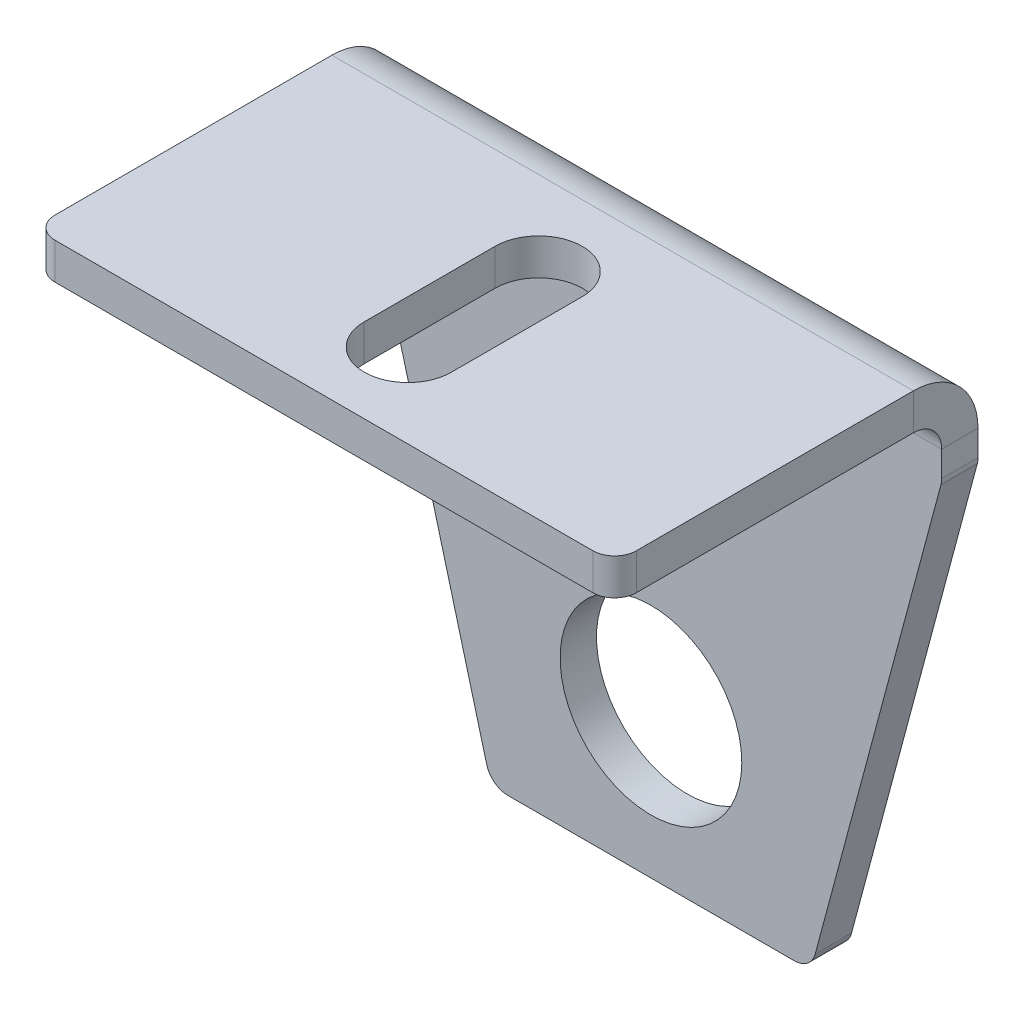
ISO-10303-21;
HEADER;
FILE_DESCRIPTION(('STEP AP214'),'2;1');
FILE_NAME('part.step','',(''),(''),'','','');
FILE_SCHEMA(('AUTOMOTIVE_DESIGN { 1 0 10303 214 1 1 1 1 }'));
ENDSEC;
DATA;
#1=APPLICATION_CONTEXT('core data for automotive mechanical design processes');
#2=APPLICATION_PROTOCOL_DEFINITION('international standard','automotive_design',2000,#1);
#3=PRODUCT_CONTEXT('',#1,'mechanical');
#4=PRODUCT('Part','Part','',(#3));
#5=PRODUCT_RELATED_PRODUCT_CATEGORY('part','',(#4));
#6=PRODUCT_DEFINITION_FORMATION('','',#4);
#7=PRODUCT_DEFINITION_CONTEXT('part definition',#1,'design');
#8=PRODUCT_DEFINITION('design','',#6,#7);
#9=PRODUCT_DEFINITION_SHAPE('','',#8);
#10=(LENGTH_UNIT() NAMED_UNIT(*) SI_UNIT(.MILLI.,.METRE.));
#11=(NAMED_UNIT(*) PLANE_ANGLE_UNIT() SI_UNIT($,.RADIAN.));
#12=(NAMED_UNIT(*) SI_UNIT($,.STERADIAN.) SOLID_ANGLE_UNIT());
#13=UNCERTAINTY_MEASURE_WITH_UNIT(LENGTH_MEASURE(1.E-05),#10,'distance_accuracy_value','');
#14=(GEOMETRIC_REPRESENTATION_CONTEXT(3) GLOBAL_UNCERTAINTY_ASSIGNED_CONTEXT((#13)) GLOBAL_UNIT_ASSIGNED_CONTEXT((#10,
#11,#12)) REPRESENTATION_CONTEXT('',''));
#15=CARTESIAN_POINT('',(0.,0.,0.));
#16=DIRECTION('',(0.,0.,1.));
#17=DIRECTION('',(1.,0.,0.));
#18=AXIS2_PLACEMENT_3D('',#15,#16,#17);
#19=CARTESIAN_POINT('',(-40.,-40.,-5.));
#20=DIRECTION('',(-1.,0.,0.));
#21=DIRECTION('',(0.,0.,1.));
#22=AXIS2_PLACEMENT_3D('',#19,#20,#21);
#23=PLANE('',#22);
#24=DIRECTION('',(0.,-1.,0.));
#25=VECTOR('',#24,1.);
#26=CARTESIAN_POINT('',(-40.,-40.,-5.));
#27=LINE('',#26,#25);
#28=CARTESIAN_POINT('',(-40.,31.1,-5.));
#29=VERTEX_POINT('',#28);
#30=CARTESIAN_POINT('',(-40.,27.5718720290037,-5.));
#31=VERTEX_POINT('',#30);
#32=EDGE_CURVE('E297',#29,#31,#27,.T.);
#33=ORIENTED_EDGE('',*,*,#32,.T.);
#34=DIRECTION('',(0.,0.,1.));
#35=VECTOR('',#34,1.);
#36=CARTESIAN_POINT('',(-40.,27.5718720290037,-5.));
#37=LINE('',#36,#35);
#38=CARTESIAN_POINT('',(-40.,27.5718720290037,0.));
#39=VERTEX_POINT('',#38);
#40=EDGE_CURVE('E345',#31,#39,#37,.T.);
#41=ORIENTED_EDGE('',*,*,#40,.T.);
#42=DIRECTION('',(0.,-1.,0.));
#43=VECTOR('',#42,1.);
#44=CARTESIAN_POINT('',(-40.,-40.,0.));
#45=LINE('',#44,#43);
#46=CARTESIAN_POINT('',(-40.,31.1,0.));
#47=VERTEX_POINT('',#46);
#48=EDGE_CURVE('E294',#47,#39,#45,.T.);
#49=ORIENTED_EDGE('',*,*,#48,.F.);
#50=DIRECTION('',(0.,0.,-1.));
#51=VECTOR('',#50,1.);
#52=CARTESIAN_POINT('',(-40.,31.1,0.));
#53=LINE('',#52,#51);
#54=EDGE_CURVE('E280',#47,#29,#53,.T.);
#55=ORIENTED_EDGE('',*,*,#54,.T.);
#56=EDGE_LOOP('',(#33,#41,#49,#55));
#57=FACE_BOUND('',#56,.T.);
#58=ADVANCED_FACE('F54',(#57),#23,.T.);
#59=CARTESIAN_POINT('',(0.,0.,-5.));
#60=DIRECTION('',(0.,0.,1.));
#61=DIRECTION('',(1.,0.,0.));
#62=AXIS2_PLACEMENT_3D('',#59,#60,#61);
#63=PLANE('',#62);
#64=CARTESIAN_POINT('',(0.,-19.9999999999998,-5.));
#65=DIRECTION('',(0.,0.,1.));
#66=DIRECTION('',(1.,0.,0.));
#67=AXIS2_PLACEMENT_3D('',#64,#65,#66);
#68=CIRCLE('',#67,12.5);
#69=CARTESIAN_POINT('',(12.5,-19.9999999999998,-5.));
#70=VERTEX_POINT('',#69);
#71=EDGE_CURVE('E242',#70,#70,#68,.F.);
#72=ORIENTED_EDGE('',*,*,#71,.F.);
#73=EDGE_LOOP('',(#72));
#74=FACE_BOUND('',#73,.T.);
#75=DIRECTION('',(1.,0.,0.));
#76=VECTOR('',#75,1.);
#77=CARTESIAN_POINT('',(40.,-40.,-5.));
#78=LINE('',#77,#76);
#79=CARTESIAN_POINT('',(-19.6980190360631,-40.,-5.));
#80=VERTEX_POINT('',#79);
#81=CARTESIAN_POINT('',(19.6980190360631,-40.,-5.));
#82=VERTEX_POINT('',#81);
#83=EDGE_CURVE('E300',#80,#82,#78,.T.);
#84=ORIENTED_EDGE('',*,*,#83,.F.);
#85=CARTESIAN_POINT('',(-19.6980190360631,-37.,-5.));
#86=DIRECTION('',(0.,0.,1.));
#87=DIRECTION('',(1.,0.,0.));
#88=AXIS2_PLACEMENT_3D('',#85,#86,#87);
#89=CIRCLE('',#88,3.);
#90=CARTESIAN_POINT('',(-22.5957965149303,-37.7764571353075,-5.));
#91=VERTEX_POINT('',#90);
#92=EDGE_CURVE('E336',#80,#91,#89,.F.);
#93=ORIENTED_EDGE('',*,*,#92,.T.);
#94=DIRECTION('',(0.258819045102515,-0.96592582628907,0.));
#95=VECTOR('',#94,1.);
#96=CARTESIAN_POINT('',(-40.,27.1769145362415,-5.));
#97=LINE('',#96,#95);
#98=CARTESIAN_POINT('',(-39.8977774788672,26.7954148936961,-5.));
#99=VERTEX_POINT('',#98);
#100=EDGE_CURVE('E232',#99,#91,#97,.T.);
#101=ORIENTED_EDGE('',*,*,#100,.F.);
#102=CARTESIAN_POINT('',(-37.,27.5718720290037,-5.));
#103=DIRECTION('',(0.,0.,1.));
#104=DIRECTION('',(1.,0.,0.));
#105=AXIS2_PLACEMENT_3D('',#102,#103,#104);
#106=CIRCLE('',#105,3.);
#107=EDGE_CURVE('E330',#99,#31,#106,.F.);
#108=ORIENTED_EDGE('',*,*,#107,.T.);
#109=ORIENTED_EDGE('',*,*,#32,.F.);
#110=DIRECTION('',(-1.,0.,0.));
#111=VECTOR('',#110,1.);
#112=CARTESIAN_POINT('',(-40.,31.1,-5.));
#113=LINE('',#112,#111);
#114=CARTESIAN_POINT('',(40.,31.1000000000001,-5.));
#115=VERTEX_POINT('',#114);
#116=EDGE_CURVE('E273',#29,#115,#113,.F.);
#117=ORIENTED_EDGE('',*,*,#116,.T.);
#118=DIRECTION('',(0.,1.,0.));
#119=VECTOR('',#118,1.);
#120=CARTESIAN_POINT('',(40.,-40.,-5.));
#121=LINE('',#120,#119);
#122=CARTESIAN_POINT('',(40.,27.5718720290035,-5.));
#123=VERTEX_POINT('',#122);
#124=EDGE_CURVE('E304',#123,#115,#121,.T.);
#125=ORIENTED_EDGE('',*,*,#124,.F.);
#126=CARTESIAN_POINT('',(37.,27.5718720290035,-5.));
#127=DIRECTION('',(0.,0.,1.));
#128=DIRECTION('',(1.,0.,0.));
#129=AXIS2_PLACEMENT_3D('',#126,#127,#128);
#130=CIRCLE('',#129,3.);
#131=CARTESIAN_POINT('',(39.8977774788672,26.7954148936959,-5.));
#132=VERTEX_POINT('',#131);
#133=EDGE_CURVE('E332',#123,#132,#130,.F.);
#134=ORIENTED_EDGE('',*,*,#133,.T.);
#135=DIRECTION('',(0.258819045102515,0.96592582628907,0.));
#136=VECTOR('',#135,1.);
#137=CARTESIAN_POINT('',(40.,27.1769145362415,-5.));
#138=LINE('',#137,#136);
#139=CARTESIAN_POINT('',(22.5957965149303,-37.7764571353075,-5.));
#140=VERTEX_POINT('',#139);
#141=EDGE_CURVE('E224',#140,#132,#138,.T.);
#142=ORIENTED_EDGE('',*,*,#141,.F.);
#143=CARTESIAN_POINT('',(19.6980190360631,-37.,-5.));
#144=DIRECTION('',(0.,0.,1.));
#145=DIRECTION('',(1.,0.,0.));
#146=AXIS2_PLACEMENT_3D('',#143,#144,#145);
#147=CIRCLE('',#146,3.);
#148=EDGE_CURVE('E334',#140,#82,#147,.F.);
#149=ORIENTED_EDGE('',*,*,#148,.T.);
#150=EDGE_LOOP('',(#84,#93,#101,#108,#109,#117,#125,#134,#142,#149));
#151=FACE_BOUND('',#150,.T.);
#152=ADVANCED_FACE('F441',(#74,#151),#63,.F.);
#153=CARTESIAN_POINT('',(0.,0.,0.));
#154=DIRECTION('',(0.,0.,1.));
#155=DIRECTION('',(1.,0.,0.));
#156=AXIS2_PLACEMENT_3D('',#153,#154,#155);
#157=PLANE('',#156);
#158=CARTESIAN_POINT('',(0.,-19.9999999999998,0.));
#159=DIRECTION('',(0.,0.,1.));
#160=DIRECTION('',(1.,0.,0.));
#161=AXIS2_PLACEMENT_3D('',#158,#159,#160);
#162=CIRCLE('',#161,12.5);
#163=CARTESIAN_POINT('',(12.5,-19.9999999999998,0.));
#164=VERTEX_POINT('',#163);
#165=EDGE_CURVE('E231',#164,#164,#162,.T.);
#166=ORIENTED_EDGE('',*,*,#165,.F.);
#167=EDGE_LOOP('',(#166));
#168=FACE_BOUND('',#167,.T.);
#169=DIRECTION('',(0.258819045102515,-0.96592582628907,0.));
#170=VECTOR('',#169,1.);
#171=CARTESIAN_POINT('',(-40.,27.1769145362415,0.));
#172=LINE('',#171,#170);
#173=CARTESIAN_POINT('',(-39.8977774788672,26.7954148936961,0.));
#174=VERTEX_POINT('',#173);
#175=CARTESIAN_POINT('',(-22.5957965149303,-37.7764571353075,0.));
#176=VERTEX_POINT('',#175);
#177=EDGE_CURVE('E228',#174,#176,#172,.T.);
#178=ORIENTED_EDGE('',*,*,#177,.T.);
#179=CARTESIAN_POINT('',(-19.6980190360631,-37.,0.));
#180=DIRECTION('',(0.,0.,1.));
#181=DIRECTION('',(1.,0.,0.));
#182=AXIS2_PLACEMENT_3D('',#179,#180,#181);
#183=CIRCLE('',#182,3.);
#184=CARTESIAN_POINT('',(-19.6980190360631,-40.,0.));
#185=VERTEX_POINT('',#184);
#186=EDGE_CURVE('E323',#176,#185,#183,.T.);
#187=ORIENTED_EDGE('',*,*,#186,.T.);
#188=DIRECTION('',(1.,0.,0.));
#189=VECTOR('',#188,1.);
#190=CARTESIAN_POINT('',(40.,-40.,0.));
#191=LINE('',#190,#189);
#192=CARTESIAN_POINT('',(19.6980190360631,-40.,0.));
#193=VERTEX_POINT('',#192);
#194=EDGE_CURVE('E309',#185,#193,#191,.T.);
#195=ORIENTED_EDGE('',*,*,#194,.T.);
#196=CARTESIAN_POINT('',(19.6980190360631,-37.,0.));
#197=DIRECTION('',(0.,0.,1.));
#198=DIRECTION('',(1.,0.,0.));
#199=AXIS2_PLACEMENT_3D('',#196,#197,#198);
#200=CIRCLE('',#199,3.);
#201=CARTESIAN_POINT('',(22.5957965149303,-37.7764571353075,0.));
#202=VERTEX_POINT('',#201);
#203=EDGE_CURVE('E321',#193,#202,#200,.T.);
#204=ORIENTED_EDGE('',*,*,#203,.T.);
#205=DIRECTION('',(0.258819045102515,0.96592582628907,0.));
#206=VECTOR('',#205,1.);
#207=CARTESIAN_POINT('',(40.,27.1769145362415,0.));
#208=LINE('',#207,#206);
#209=CARTESIAN_POINT('',(39.8977774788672,26.7954148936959,0.));
#210=VERTEX_POINT('',#209);
#211=EDGE_CURVE('E235',#202,#210,#208,.T.);
#212=ORIENTED_EDGE('',*,*,#211,.T.);
#213=CARTESIAN_POINT('',(37.,27.5718720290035,0.));
#214=DIRECTION('',(0.,0.,1.));
#215=DIRECTION('',(1.,0.,0.));
#216=AXIS2_PLACEMENT_3D('',#213,#214,#215);
#217=CIRCLE('',#216,3.);
#218=CARTESIAN_POINT('',(40.,27.5718720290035,0.));
#219=VERTEX_POINT('',#218);
#220=EDGE_CURVE('E319',#210,#219,#217,.T.);
#221=ORIENTED_EDGE('',*,*,#220,.T.);
#222=DIRECTION('',(0.,1.,0.));
#223=VECTOR('',#222,1.);
#224=CARTESIAN_POINT('',(40.,-40.,0.));
#225=LINE('',#224,#223);
#226=CARTESIAN_POINT('',(40.,31.1,0.));
#227=VERTEX_POINT('',#226);
#228=EDGE_CURVE('E301',#219,#227,#225,.T.);
#229=ORIENTED_EDGE('',*,*,#228,.T.);
#230=DIRECTION('',(-1.,0.,0.));
#231=VECTOR('',#230,1.);
#232=CARTESIAN_POINT('',(-40.,31.1,0.));
#233=LINE('',#232,#231);
#234=EDGE_CURVE('E286',#47,#227,#233,.F.);
#235=ORIENTED_EDGE('',*,*,#234,.F.);
#236=ORIENTED_EDGE('',*,*,#48,.T.);
#237=CARTESIAN_POINT('',(-37.,27.5718720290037,0.));
#238=DIRECTION('',(0.,0.,1.));
#239=DIRECTION('',(1.,0.,0.));
#240=AXIS2_PLACEMENT_3D('',#237,#238,#239);
#241=CIRCLE('',#240,3.);
#242=EDGE_CURVE('E317',#39,#174,#241,.T.);
#243=ORIENTED_EDGE('',*,*,#242,.T.);
#244=EDGE_LOOP('',(#178,#187,#195,#204,#212,#221,#229,#235,#236,#243));
#245=FACE_BOUND('',#244,.T.);
#246=ADVANCED_FACE('F402',(#168,#245),#157,.T.);
#247=CARTESIAN_POINT('',(40.,-40.,-5.));
#248=DIRECTION('',(1.,0.,0.));
#249=DIRECTION('',(0.,1.,0.));
#250=AXIS2_PLACEMENT_3D('',#247,#248,#249);
#251=PLANE('',#250);
#252=ORIENTED_EDGE('',*,*,#228,.F.);
#253=DIRECTION('',(0.,0.,1.));
#254=VECTOR('',#253,1.);
#255=CARTESIAN_POINT('',(40.,27.5718720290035,-5.));
#256=LINE('',#255,#254);
#257=EDGE_CURVE('E343',#219,#123,#256,.F.);
#258=ORIENTED_EDGE('',*,*,#257,.T.);
#259=ORIENTED_EDGE('',*,*,#124,.T.);
#260=DIRECTION('',(0.,0.,-1.));
#261=VECTOR('',#260,1.);
#262=CARTESIAN_POINT('',(40.,31.1,0.));
#263=LINE('',#262,#261);
#264=EDGE_CURVE('E291',#227,#115,#263,.T.);
#265=ORIENTED_EDGE('',*,*,#264,.F.);
#266=EDGE_LOOP('',(#252,#258,#259,#265));
#267=FACE_BOUND('',#266,.T.);
#268=ADVANCED_FACE('F438',(#267),#251,.T.);
#269=CARTESIAN_POINT('',(40.,-40.,-5.));
#270=DIRECTION('',(0.,-1.,0.));
#271=DIRECTION('',(1.,0.,0.));
#272=AXIS2_PLACEMENT_3D('',#269,#270,#271);
#273=PLANE('',#272);
#274=ORIENTED_EDGE('',*,*,#194,.F.);
#275=DIRECTION('',(0.,0.,1.));
#276=VECTOR('',#275,1.);
#277=CARTESIAN_POINT('',(-19.6980190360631,-40.,-5.));
#278=LINE('',#277,#276);
#279=EDGE_CURVE('E328',#185,#80,#278,.F.);
#280=ORIENTED_EDGE('',*,*,#279,.T.);
#281=ORIENTED_EDGE('',*,*,#83,.T.);
#282=DIRECTION('',(0.,0.,1.));
#283=VECTOR('',#282,1.);
#284=CARTESIAN_POINT('',(19.6980190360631,-40.,-5.));
#285=LINE('',#284,#283);
#286=EDGE_CURVE('E325',#82,#193,#285,.T.);
#287=ORIENTED_EDGE('',*,*,#286,.T.);
#288=EDGE_LOOP('',(#274,#280,#281,#287));
#289=FACE_BOUND('',#288,.T.);
#290=ADVANCED_FACE('F421',(#289),#273,.T.);
#291=CARTESIAN_POINT('',(40.,31.1,3.9));
#292=DIRECTION('',(1.,0.,0.));
#293=DIRECTION('',(0.,0.,-1.));
#294=AXIS2_PLACEMENT_3D('',#291,#292,#293);
#295=PLANE('',#294);
#296=DIRECTION('',(0.,-1.,0.));
#297=VECTOR('',#296,1.);
#298=CARTESIAN_POINT('',(40.,40.,3.89999999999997));
#299=LINE('',#298,#297);
#300=CARTESIAN_POINT('',(40.,35.,3.89999999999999));
#301=VERTEX_POINT('',#300);
#302=CARTESIAN_POINT('',(40.,40.,3.89999999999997));
#303=VERTEX_POINT('',#302);
#304=EDGE_CURVE('E245',#301,#303,#299,.F.);
#305=ORIENTED_EDGE('',*,*,#304,.F.);
#306=CARTESIAN_POINT('',(40.,31.1,3.9));
#307=DIRECTION('',(-1.,0.,0.));
#308=DIRECTION('',(0.,0.,1.));
#309=AXIS2_PLACEMENT_3D('',#306,#307,#308);
#310=CIRCLE('',#309,3.9);
#311=EDGE_CURVE('E283',#227,#301,#310,.F.);
#312=ORIENTED_EDGE('',*,*,#311,.F.);
#313=ORIENTED_EDGE('',*,*,#264,.T.);
#314=CARTESIAN_POINT('',(40.,31.1,3.9));
#315=DIRECTION('',(-1.,0.,0.));
#316=DIRECTION('',(0.,0.,1.));
#317=AXIS2_PLACEMENT_3D('',#314,#315,#316);
#318=CIRCLE('',#317,8.9);
#319=EDGE_CURVE('E276',#115,#303,#318,.F.);
#320=ORIENTED_EDGE('',*,*,#319,.T.);
#321=EDGE_LOOP('',(#305,#312,#313,#320));
#322=FACE_BOUND('',#321,.T.);
#323=ADVANCED_FACE('F391',(#322),#295,.T.);
#324=CARTESIAN_POINT('',(-40.,31.1,3.9));
#325=DIRECTION('',(1.,0.,0.));
#326=DIRECTION('',(0.,0.,-1.));
#327=AXIS2_PLACEMENT_3D('',#324,#325,#326);
#328=PLANE('',#327);
#329=CARTESIAN_POINT('',(-40.,31.1,3.9));
#330=DIRECTION('',(-1.,0.,0.));
#331=DIRECTION('',(0.,0.,1.));
#332=AXIS2_PLACEMENT_3D('',#329,#330,#331);
#333=CIRCLE('',#332,3.9);
#334=CARTESIAN_POINT('',(-40.,35.,3.89999999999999));
#335=VERTEX_POINT('',#334);
#336=EDGE_CURVE('E249',#335,#47,#333,.T.);
#337=ORIENTED_EDGE('',*,*,#336,.F.);
#338=DIRECTION('',(0.,-1.,0.));
#339=VECTOR('',#338,1.);
#340=CARTESIAN_POINT('',(-40.,35.,3.89999999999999));
#341=LINE('',#340,#339);
#342=CARTESIAN_POINT('',(-40.,40.,3.89999999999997));
#343=VERTEX_POINT('',#342);
#344=EDGE_CURVE('E266',#335,#343,#341,.F.);
#345=ORIENTED_EDGE('',*,*,#344,.T.);
#346=CARTESIAN_POINT('',(-40.,31.1,3.9));
#347=DIRECTION('',(-1.,0.,0.));
#348=DIRECTION('',(0.,0.,1.));
#349=AXIS2_PLACEMENT_3D('',#346,#347,#348);
#350=CIRCLE('',#349,8.9);
#351=EDGE_CURVE('E277',#343,#29,#350,.T.);
#352=ORIENTED_EDGE('',*,*,#351,.T.);
#353=ORIENTED_EDGE('',*,*,#54,.F.);
#354=EDGE_LOOP('',(#337,#345,#352,#353));
#355=FACE_BOUND('',#354,.T.);
#356=ADVANCED_FACE('F382',(#355),#328,.F.);
#357=CARTESIAN_POINT('',(-40.,31.1,3.9));
#358=DIRECTION('',(-1.,0.,0.));
#359=DIRECTION('',(0.,1.,0.));
#360=AXIS2_PLACEMENT_3D('',#357,#358,#359);
#361=CYLINDRICAL_SURFACE('',#360,8.9);
#362=ORIENTED_EDGE('',*,*,#116,.F.);
#363=ORIENTED_EDGE('',*,*,#351,.F.);
#364=DIRECTION('',(-1.,0.,0.));
#365=VECTOR('',#364,1.);
#366=CARTESIAN_POINT('',(40.,40.,3.89999999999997));
#367=LINE('',#366,#365);
#368=EDGE_CURVE('E263',#343,#303,#367,.F.);
#369=ORIENTED_EDGE('',*,*,#368,.T.);
#370=ORIENTED_EDGE('',*,*,#319,.F.);
#371=EDGE_LOOP('',(#362,#363,#369,#370));
#372=FACE_BOUND('',#371,.T.);
#373=ADVANCED_FACE('F388',(#372),#361,.T.);
#374=CARTESIAN_POINT('',(-40.,31.1,3.9));
#375=DIRECTION('',(-1.,0.,0.));
#376=DIRECTION('',(0.,1.,0.));
#377=AXIS2_PLACEMENT_3D('',#374,#375,#376);
#378=CYLINDRICAL_SURFACE('',#377,3.9);
#379=ORIENTED_EDGE('',*,*,#234,.T.);
#380=ORIENTED_EDGE('',*,*,#311,.T.);
#381=DIRECTION('',(-1.,0.,0.));
#382=VECTOR('',#381,1.);
#383=CARTESIAN_POINT('',(40.,35.,3.89999999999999));
#384=LINE('',#383,#382);
#385=EDGE_CURVE('E269',#301,#335,#384,.T.);
#386=ORIENTED_EDGE('',*,*,#385,.T.);
#387=ORIENTED_EDGE('',*,*,#336,.T.);
#388=EDGE_LOOP('',(#379,#380,#386,#387));
#389=FACE_BOUND('',#388,.T.);
#390=ADVANCED_FACE('F399',(#389),#378,.F.);
#391=CARTESIAN_POINT('',(40.,40.,0.));
#392=DIRECTION('',(-1.,0.,0.));
#393=DIRECTION('',(0.,0.,1.));
#394=AXIS2_PLACEMENT_3D('',#391,#392,#393);
#395=PLANE('',#394);
#396=DIRECTION('',(0.,0.,-1.));
#397=VECTOR('',#396,1.);
#398=CARTESIAN_POINT('',(40.,40.,-1.59319237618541E-13));
#399=LINE('',#398,#397);
#400=CARTESIAN_POINT('',(40.,40.0000000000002,42.));
#401=VERTEX_POINT('',#400);
#402=EDGE_CURVE('E253',#401,#303,#399,.T.);
#403=ORIENTED_EDGE('',*,*,#402,.F.);
#404=DIRECTION('',(0.,-1.,0.));
#405=VECTOR('',#404,1.);
#406=CARTESIAN_POINT('',(40.,40.0000000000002,42.));
#407=LINE('',#406,#405);
#408=CARTESIAN_POINT('',(40.,35.0000000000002,42.));
#409=VERTEX_POINT('',#408);
#410=EDGE_CURVE('E13',#401,#409,#407,.T.);
#411=ORIENTED_EDGE('',*,*,#410,.T.);
#412=DIRECTION('',(0.,0.,1.));
#413=VECTOR('',#412,1.);
#414=CARTESIAN_POINT('',(40.,35.,0.));
#415=LINE('',#414,#413);
#416=EDGE_CURVE('E261',#409,#301,#415,.F.);
#417=ORIENTED_EDGE('',*,*,#416,.T.);
#418=ORIENTED_EDGE('',*,*,#304,.T.);
#419=EDGE_LOOP('',(#403,#411,#417,#418));
#420=FACE_BOUND('',#419,.T.);
#421=ADVANCED_FACE('F395',(#420),#395,.F.);
#422=CARTESIAN_POINT('',(-40.,40.0000000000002,45.));
#423=DIRECTION('',(1.,0.,0.));
#424=DIRECTION('',(0.,0.,-1.));
#425=AXIS2_PLACEMENT_3D('',#422,#423,#424);
#426=PLANE('',#425);
#427=DIRECTION('',(0.,0.,-1.));
#428=VECTOR('',#427,1.);
#429=CARTESIAN_POINT('',(-40.,35.0000000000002,45.));
#430=LINE('',#429,#428);
#431=CARTESIAN_POINT('',(-40.,35.0000000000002,42.));
#432=VERTEX_POINT('',#431);
#433=EDGE_CURVE('E258',#335,#432,#430,.F.);
#434=ORIENTED_EDGE('',*,*,#433,.T.);
#435=DIRECTION('',(0.,-1.,0.));
#436=VECTOR('',#435,1.);
#437=CARTESIAN_POINT('',(-40.,40.0000000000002,42.));
#438=LINE('',#437,#436);
#439=CARTESIAN_POINT('',(-40.,40.0000000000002,42.));
#440=VERTEX_POINT('',#439);
#441=EDGE_CURVE('E357',#432,#440,#438,.F.);
#442=ORIENTED_EDGE('',*,*,#441,.T.);
#443=DIRECTION('',(0.,0.,1.));
#444=VECTOR('',#443,1.);
#445=CARTESIAN_POINT('',(-40.,40.,-1.59319237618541E-13));
#446=LINE('',#445,#444);
#447=EDGE_CURVE('E250',#343,#440,#446,.T.);
#448=ORIENTED_EDGE('',*,*,#447,.F.);
#449=ORIENTED_EDGE('',*,*,#344,.F.);
#450=EDGE_LOOP('',(#434,#442,#448,#449));
#451=FACE_BOUND('',#450,.T.);
#452=ADVANCED_FACE('F379',(#451),#426,.F.);
#453=CARTESIAN_POINT('',(0.,40.,-1.59319237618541E-13));
#454=DIRECTION('',(0.,-1.,0.));
#455=DIRECTION('',(0.,0.,-1.));
#456=AXIS2_PLACEMENT_3D('',#453,#454,#455);
#457=PLANE('',#456);
#458=DIRECTION('',(0.,0.,-1.));
#459=VECTOR('',#458,1.);
#460=CARTESIAN_POINT('',(-6.,40.0000000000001,15.45));
#461=LINE('',#460,#459);
#462=CARTESIAN_POINT('',(-6.,40.0000000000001,33.45));
#463=VERTEX_POINT('',#462);
#464=CARTESIAN_POINT('',(-6.,40.0000000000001,15.45));
#465=VERTEX_POINT('',#464);
#466=EDGE_CURVE('E199',#463,#465,#461,.T.);
#467=ORIENTED_EDGE('',*,*,#466,.T.);
#468=CARTESIAN_POINT('',(0.,40.0000000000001,15.45));
#469=DIRECTION('',(0.,-1.,0.));
#470=DIRECTION('',(0.,0.,-1.));
#471=AXIS2_PLACEMENT_3D('',#468,#469,#470);
#472=CIRCLE('',#471,6.);
#473=CARTESIAN_POINT('',(6.,40.0000000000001,15.45));
#474=VERTEX_POINT('',#473);
#475=EDGE_CURVE('E193',#465,#474,#472,.T.);
#476=ORIENTED_EDGE('',*,*,#475,.T.);
#477=DIRECTION('',(0.,0.,1.));
#478=VECTOR('',#477,1.);
#479=CARTESIAN_POINT('',(6.,40.0000000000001,15.45));
#480=LINE('',#479,#478);
#481=CARTESIAN_POINT('',(6.,40.0000000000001,33.45));
#482=VERTEX_POINT('',#481);
#483=EDGE_CURVE('E202',#474,#482,#480,.T.);
#484=ORIENTED_EDGE('',*,*,#483,.T.);
#485=CARTESIAN_POINT('',(0.,40.0000000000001,33.45));
#486=DIRECTION('',(0.,-1.,0.));
#487=DIRECTION('',(0.,0.,-1.));
#488=AXIS2_PLACEMENT_3D('',#485,#486,#487);
#489=CIRCLE('',#488,6.);
#490=EDGE_CURVE('E69',#482,#463,#489,.T.);
#491=ORIENTED_EDGE('',*,*,#490,.T.);
#492=EDGE_LOOP('',(#467,#476,#484,#491));
#493=FACE_BOUND('',#492,.T.);
#494=ORIENTED_EDGE('',*,*,#447,.T.);
#495=CARTESIAN_POINT('',(-37.,40.0000000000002,42.));
#496=DIRECTION('',(0.,-1.,0.));
#497=DIRECTION('',(0.,0.,-1.));
#498=AXIS2_PLACEMENT_3D('',#495,#496,#497);
#499=CIRCLE('',#498,3.);
#500=CARTESIAN_POINT('',(-37.,40.0000000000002,45.));
#501=VERTEX_POINT('',#500);
#502=EDGE_CURVE('E62',#440,#501,#499,.F.);
#503=ORIENTED_EDGE('',*,*,#502,.T.);
#504=DIRECTION('',(1.,0.,0.));
#505=VECTOR('',#504,1.);
#506=CARTESIAN_POINT('',(0.,40.0000000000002,45.));
#507=LINE('',#506,#505);
#508=CARTESIAN_POINT('',(37.,40.0000000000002,45.));
#509=VERTEX_POINT('',#508);
#510=EDGE_CURVE('E246',#501,#509,#507,.T.);
#511=ORIENTED_EDGE('',*,*,#510,.T.);
#512=CARTESIAN_POINT('',(37.,40.0000000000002,42.));
#513=DIRECTION('',(0.,-1.,0.));
#514=DIRECTION('',(0.,0.,-1.));
#515=AXIS2_PLACEMENT_3D('',#512,#513,#514);
#516=CIRCLE('',#515,3.);
#517=EDGE_CURVE('E359',#509,#401,#516,.F.);
#518=ORIENTED_EDGE('',*,*,#517,.T.);
#519=ORIENTED_EDGE('',*,*,#402,.T.);
#520=ORIENTED_EDGE('',*,*,#368,.F.);
#521=EDGE_LOOP('',(#494,#503,#511,#518,#519,#520));
#522=FACE_BOUND('',#521,.T.);
#523=ADVANCED_FACE('F206',(#493,#522),#457,.F.);
#524=CARTESIAN_POINT('',(0.,35.,-1.41861830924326E-13));
#525=DIRECTION('',(0.,-1.,0.));
#526=DIRECTION('',(0.,0.,-1.));
#527=AXIS2_PLACEMENT_3D('',#524,#525,#526);
#528=PLANE('',#527);
#529=CARTESIAN_POINT('',(0.,35.0000000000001,15.45));
#530=DIRECTION('',(0.,-1.,0.));
#531=DIRECTION('',(0.,0.,-1.));
#532=AXIS2_PLACEMENT_3D('',#529,#530,#531);
#533=CIRCLE('',#532,6.);
#534=CARTESIAN_POINT('',(-6.,35.0000000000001,15.45));
#535=VERTEX_POINT('',#534);
#536=CARTESIAN_POINT('',(6.,35.0000000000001,15.45));
#537=VERTEX_POINT('',#536);
#538=EDGE_CURVE('E77',#535,#537,#533,.T.);
#539=ORIENTED_EDGE('',*,*,#538,.F.);
#540=DIRECTION('',(0.,0.,-1.));
#541=VECTOR('',#540,1.);
#542=CARTESIAN_POINT('',(-6.,35.0000000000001,15.45));
#543=LINE('',#542,#541);
#544=CARTESIAN_POINT('',(-6.,35.0000000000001,33.45));
#545=VERTEX_POINT('',#544);
#546=EDGE_CURVE('E209',#545,#535,#543,.T.);
#547=ORIENTED_EDGE('',*,*,#546,.F.);
#548=CARTESIAN_POINT('',(0.,35.0000000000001,33.45));
#549=DIRECTION('',(0.,-1.,0.));
#550=DIRECTION('',(0.,0.,-1.));
#551=AXIS2_PLACEMENT_3D('',#548,#549,#550);
#552=CIRCLE('',#551,6.);
#553=CARTESIAN_POINT('',(6.,35.0000000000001,33.45));
#554=VERTEX_POINT('',#553);
#555=EDGE_CURVE('E212',#554,#545,#552,.T.);
#556=ORIENTED_EDGE('',*,*,#555,.F.);
#557=DIRECTION('',(0.,0.,1.));
#558=VECTOR('',#557,1.);
#559=CARTESIAN_POINT('',(6.,35.0000000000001,15.45));
#560=LINE('',#559,#558);
#561=EDGE_CURVE('E218',#537,#554,#560,.T.);
#562=ORIENTED_EDGE('',*,*,#561,.F.);
#563=EDGE_LOOP('',(#539,#547,#556,#562));
#564=FACE_BOUND('',#563,.T.);
#565=DIRECTION('',(-1.,0.,0.));
#566=VECTOR('',#565,1.);
#567=CARTESIAN_POINT('',(40.,35.0000000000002,45.));
#568=LINE('',#567,#566);
#569=CARTESIAN_POINT('',(-37.,35.0000000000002,45.));
#570=VERTEX_POINT('',#569);
#571=CARTESIAN_POINT('',(37.,35.0000000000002,45.));
#572=VERTEX_POINT('',#571);
#573=EDGE_CURVE('E255',#570,#572,#568,.F.);
#574=ORIENTED_EDGE('',*,*,#573,.F.);
#575=CARTESIAN_POINT('',(-37.,35.0000000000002,42.));
#576=DIRECTION('',(0.,-1.,0.));
#577=DIRECTION('',(0.,0.,-1.));
#578=AXIS2_PLACEMENT_3D('',#575,#576,#577);
#579=CIRCLE('',#578,3.);
#580=EDGE_CURVE('E355',#570,#432,#579,.T.);
#581=ORIENTED_EDGE('',*,*,#580,.T.);
#582=ORIENTED_EDGE('',*,*,#433,.F.);
#583=ORIENTED_EDGE('',*,*,#385,.F.);
#584=ORIENTED_EDGE('',*,*,#416,.F.);
#585=CARTESIAN_POINT('',(37.,35.0000000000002,42.));
#586=DIRECTION('',(0.,-1.,0.));
#587=DIRECTION('',(0.,0.,-1.));
#588=AXIS2_PLACEMENT_3D('',#585,#586,#587);
#589=CIRCLE('',#588,3.);
#590=EDGE_CURVE('E353',#409,#572,#589,.T.);
#591=ORIENTED_EDGE('',*,*,#590,.T.);
#592=EDGE_LOOP('',(#574,#581,#582,#583,#584,#591));
#593=FACE_BOUND('',#592,.T.);
#594=ADVANCED_FACE('F375',(#564,#593),#528,.T.);
#595=CARTESIAN_POINT('',(40.,40.0000000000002,45.));
#596=DIRECTION('',(0.,0.,-1.));
#597=DIRECTION('',(0.,1.,0.));
#598=AXIS2_PLACEMENT_3D('',#595,#596,#597);
#599=PLANE('',#598);
#600=ORIENTED_EDGE('',*,*,#510,.F.);
#601=DIRECTION('',(0.,-1.,0.));
#602=VECTOR('',#601,1.);
#603=CARTESIAN_POINT('',(-37.,40.0000000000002,45.));
#604=LINE('',#603,#602);
#605=EDGE_CURVE('E350',#501,#570,#604,.T.);
#606=ORIENTED_EDGE('',*,*,#605,.T.);
#607=ORIENTED_EDGE('',*,*,#573,.T.);
#608=DIRECTION('',(0.,-1.,0.));
#609=VECTOR('',#608,1.);
#610=CARTESIAN_POINT('',(37.,40.0000000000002,45.));
#611=LINE('',#610,#609);
#612=EDGE_CURVE('E348',#572,#509,#611,.F.);
#613=ORIENTED_EDGE('',*,*,#612,.T.);
#614=EDGE_LOOP('',(#600,#606,#607,#613));
#615=FACE_BOUND('',#614,.T.);
#616=ADVANCED_FACE('F369',(#615),#599,.F.);
#617=CARTESIAN_POINT('',(0.,-19.9999999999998,-40.3553390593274));
#618=DIRECTION('',(0.,0.,1.));
#619=DIRECTION('',(1.,0.,0.));
#620=AXIS2_PLACEMENT_3D('',#617,#618,#619);
#621=CYLINDRICAL_SURFACE('',#620,12.5);
#622=ORIENTED_EDGE('',*,*,#71,.T.);
#623=EDGE_LOOP('',(#622));
#624=FACE_BOUND('',#623,.T.);
#625=ORIENTED_EDGE('',*,*,#165,.T.);
#626=EDGE_LOOP('',(#625));
#627=FACE_BOUND('',#626,.T.);
#628=ADVANCED_FACE('F490',(#624,#627),#621,.F.);
#629=CARTESIAN_POINT('',(40.,27.1769145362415,-5.));
#630=DIRECTION('',(0.96592582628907,-0.258819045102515,0.));
#631=DIRECTION('',(0.258819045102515,0.96592582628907,0.));
#632=AXIS2_PLACEMENT_3D('',#629,#630,#631);
#633=PLANE('',#632);
#634=ORIENTED_EDGE('',*,*,#211,.F.);
#635=DIRECTION('',(0.,0.,1.));
#636=VECTOR('',#635,1.);
#637=CARTESIAN_POINT('',(22.5957965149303,-37.7764571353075,-5.));
#638=LINE('',#637,#636);
#639=EDGE_CURVE('E341',#202,#140,#638,.F.);
#640=ORIENTED_EDGE('',*,*,#639,.T.);
#641=ORIENTED_EDGE('',*,*,#141,.T.);
#642=DIRECTION('',(0.,0.,1.));
#643=VECTOR('',#642,1.);
#644=CARTESIAN_POINT('',(39.8977774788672,26.7954148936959,-5.));
#645=LINE('',#644,#643);
#646=EDGE_CURVE('E338',#132,#210,#645,.T.);
#647=ORIENTED_EDGE('',*,*,#646,.T.);
#648=EDGE_LOOP('',(#634,#640,#641,#647));
#649=FACE_BOUND('',#648,.T.);
#650=ADVANCED_FACE('F430',(#649),#633,.T.);
#651=CARTESIAN_POINT('',(-40.,27.1769145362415,-5.));
#652=DIRECTION('',(-0.96592582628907,-0.258819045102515,0.));
#653=DIRECTION('',(0.258819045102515,-0.96592582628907,0.));
#654=AXIS2_PLACEMENT_3D('',#651,#652,#653);
#655=PLANE('',#654);
#656=ORIENTED_EDGE('',*,*,#100,.T.);
#657=DIRECTION('',(0.,0.,1.));
#658=VECTOR('',#657,1.);
#659=CARTESIAN_POINT('',(-22.5957965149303,-37.7764571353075,-5.));
#660=LINE('',#659,#658);
#661=EDGE_CURVE('E314',#91,#176,#660,.T.);
#662=ORIENTED_EDGE('',*,*,#661,.T.);
#663=ORIENTED_EDGE('',*,*,#177,.F.);
#664=DIRECTION('',(0.,0.,1.));
#665=VECTOR('',#664,1.);
#666=CARTESIAN_POINT('',(-39.8977774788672,26.7954148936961,-5.));
#667=LINE('',#666,#665);
#668=EDGE_CURVE('E306',#174,#99,#667,.F.);
#669=ORIENTED_EDGE('',*,*,#668,.T.);
#670=EDGE_LOOP('',(#656,#662,#663,#669));
#671=FACE_BOUND('',#670,.T.);
#672=ADVANCED_FACE('F412',(#671),#655,.T.);
#673=CARTESIAN_POINT('',(-19.6980190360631,-37.,-5.));
#674=DIRECTION('',(0.,0.,1.));
#675=DIRECTION('',(1.,0.,0.));
#676=AXIS2_PLACEMENT_3D('',#673,#674,#675);
#677=CYLINDRICAL_SURFACE('',#676,3.);
#678=ORIENTED_EDGE('',*,*,#92,.F.);
#679=ORIENTED_EDGE('',*,*,#279,.F.);
#680=ORIENTED_EDGE('',*,*,#186,.F.);
#681=ORIENTED_EDGE('',*,*,#661,.F.);
#682=EDGE_LOOP('',(#678,#679,#680,#681));
#683=FACE_BOUND('',#682,.T.);
#684=ADVANCED_FACE('F417',(#683),#677,.T.);
#685=CARTESIAN_POINT('',(19.6980190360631,-37.,-5.));
#686=DIRECTION('',(0.,0.,1.));
#687=DIRECTION('',(1.,0.,0.));
#688=AXIS2_PLACEMENT_3D('',#685,#686,#687);
#689=CYLINDRICAL_SURFACE('',#688,3.);
#690=ORIENTED_EDGE('',*,*,#148,.F.);
#691=ORIENTED_EDGE('',*,*,#639,.F.);
#692=ORIENTED_EDGE('',*,*,#203,.F.);
#693=ORIENTED_EDGE('',*,*,#286,.F.);
#694=EDGE_LOOP('',(#690,#691,#692,#693));
#695=FACE_BOUND('',#694,.T.);
#696=ADVANCED_FACE('F426',(#695),#689,.T.);
#697=CARTESIAN_POINT('',(37.,27.5718720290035,-5.));
#698=DIRECTION('',(0.,0.,1.));
#699=DIRECTION('',(1.,0.,0.));
#700=AXIS2_PLACEMENT_3D('',#697,#698,#699);
#701=CYLINDRICAL_SURFACE('',#700,3.);
#702=ORIENTED_EDGE('',*,*,#133,.F.);
#703=ORIENTED_EDGE('',*,*,#257,.F.);
#704=ORIENTED_EDGE('',*,*,#220,.F.);
#705=ORIENTED_EDGE('',*,*,#646,.F.);
#706=EDGE_LOOP('',(#702,#703,#704,#705));
#707=FACE_BOUND('',#706,.T.);
#708=ADVANCED_FACE('F435',(#707),#701,.T.);
#709=CARTESIAN_POINT('',(-37.,27.5718720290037,-5.));
#710=DIRECTION('',(0.,0.,1.));
#711=DIRECTION('',(1.,0.,0.));
#712=AXIS2_PLACEMENT_3D('',#709,#710,#711);
#713=CYLINDRICAL_SURFACE('',#712,3.);
#714=ORIENTED_EDGE('',*,*,#107,.F.);
#715=ORIENTED_EDGE('',*,*,#668,.F.);
#716=ORIENTED_EDGE('',*,*,#242,.F.);
#717=ORIENTED_EDGE('',*,*,#40,.F.);
#718=EDGE_LOOP('',(#714,#715,#716,#717));
#719=FACE_BOUND('',#718,.T.);
#720=ADVANCED_FACE('F408',(#719),#713,.T.);
#721=CARTESIAN_POINT('',(-37.,40.0000000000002,42.));
#722=DIRECTION('',(0.,-1.,0.));
#723=DIRECTION('',(0.,0.,-1.));
#724=AXIS2_PLACEMENT_3D('',#721,#722,#723);
#725=CYLINDRICAL_SURFACE('',#724,3.);
#726=ORIENTED_EDGE('',*,*,#502,.F.);
#727=ORIENTED_EDGE('',*,*,#441,.F.);
#728=ORIENTED_EDGE('',*,*,#580,.F.);
#729=ORIENTED_EDGE('',*,*,#605,.F.);
#730=EDGE_LOOP('',(#726,#727,#728,#729));
#731=FACE_BOUND('',#730,.T.);
#732=ADVANCED_FACE('F372',(#731),#725,.T.);
#733=CARTESIAN_POINT('',(37.,40.0000000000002,42.));
#734=DIRECTION('',(0.,-1.,0.));
#735=DIRECTION('',(0.,0.,-1.));
#736=AXIS2_PLACEMENT_3D('',#733,#734,#735);
#737=CYLINDRICAL_SURFACE('',#736,3.);
#738=ORIENTED_EDGE('',*,*,#517,.F.);
#739=ORIENTED_EDGE('',*,*,#612,.F.);
#740=ORIENTED_EDGE('',*,*,#590,.F.);
#741=ORIENTED_EDGE('',*,*,#410,.F.);
#742=EDGE_LOOP('',(#738,#739,#740,#741));
#743=FACE_BOUND('',#742,.T.);
#744=ADVANCED_FACE('F56',(#743),#737,.T.);
#745=CARTESIAN_POINT('',(0.,40.0000000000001,15.45));
#746=DIRECTION('',(0.,-1.,0.));
#747=DIRECTION('',(0.,0.,-1.));
#748=AXIS2_PLACEMENT_3D('',#745,#746,#747);
#749=CYLINDRICAL_SURFACE('',#748,6.);
#750=ORIENTED_EDGE('',*,*,#538,.T.);
#751=DIRECTION('',(0.,-1.,0.));
#752=VECTOR('',#751,1.);
#753=CARTESIAN_POINT('',(6.,40.0000000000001,15.45));
#754=LINE('',#753,#752);
#755=EDGE_CURVE('E189',#474,#537,#754,.T.);
#756=ORIENTED_EDGE('',*,*,#755,.F.);
#757=ORIENTED_EDGE('',*,*,#475,.F.);
#758=DIRECTION('',(0.,-1.,0.));
#759=VECTOR('',#758,1.);
#760=CARTESIAN_POINT('',(-6.,40.0000000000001,15.45));
#761=LINE('',#760,#759);
#762=EDGE_CURVE('E222',#465,#535,#761,.T.);
#763=ORIENTED_EDGE('',*,*,#762,.T.);
#764=EDGE_LOOP('',(#750,#756,#757,#763));
#765=FACE_BOUND('',#764,.T.);
#766=ADVANCED_FACE('F191',(#765),#749,.F.);
#767=CARTESIAN_POINT('',(-6.,40.0000000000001,15.45));
#768=DIRECTION('',(-1.,0.,0.));
#769=DIRECTION('',(0.,0.,1.));
#770=AXIS2_PLACEMENT_3D('',#767,#768,#769);
#771=PLANE('',#770);
#772=ORIENTED_EDGE('',*,*,#546,.T.);
#773=ORIENTED_EDGE('',*,*,#762,.F.);
#774=ORIENTED_EDGE('',*,*,#466,.F.);
#775=DIRECTION('',(0.,-1.,0.));
#776=VECTOR('',#775,1.);
#777=CARTESIAN_POINT('',(-6.,40.0000000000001,33.45));
#778=LINE('',#777,#776);
#779=EDGE_CURVE('E225',#463,#545,#778,.T.);
#780=ORIENTED_EDGE('',*,*,#779,.T.);
#781=EDGE_LOOP('',(#772,#773,#774,#780));
#782=FACE_BOUND('',#781,.T.);
#783=ADVANCED_FACE('F475',(#782),#771,.F.);
#784=CARTESIAN_POINT('',(0.,40.0000000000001,33.45));
#785=DIRECTION('',(0.,-1.,0.));
#786=DIRECTION('',(0.,0.,-1.));
#787=AXIS2_PLACEMENT_3D('',#784,#785,#786);
#788=CYLINDRICAL_SURFACE('',#787,6.);
#789=ORIENTED_EDGE('',*,*,#555,.T.);
#790=ORIENTED_EDGE('',*,*,#779,.F.);
#791=ORIENTED_EDGE('',*,*,#490,.F.);
#792=DIRECTION('',(0.,-1.,0.));
#793=VECTOR('',#792,1.);
#794=CARTESIAN_POINT('',(6.,40.0000000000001,33.45));
#795=LINE('',#794,#793);
#796=EDGE_CURVE('E198',#482,#554,#795,.T.);
#797=ORIENTED_EDGE('',*,*,#796,.T.);
#798=EDGE_LOOP('',(#789,#790,#791,#797));
#799=FACE_BOUND('',#798,.T.);
#800=ADVANCED_FACE('F480',(#799),#788,.F.);
#801=CARTESIAN_POINT('',(6.,40.0000000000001,15.45));
#802=DIRECTION('',(1.,0.,0.));
#803=DIRECTION('',(0.,0.,-1.));
#804=AXIS2_PLACEMENT_3D('',#801,#802,#803);
#805=PLANE('',#804);
#806=ORIENTED_EDGE('',*,*,#561,.T.);
#807=ORIENTED_EDGE('',*,*,#796,.F.);
#808=ORIENTED_EDGE('',*,*,#483,.F.);
#809=ORIENTED_EDGE('',*,*,#755,.T.);
#810=EDGE_LOOP('',(#806,#807,#808,#809));
#811=FACE_BOUND('',#810,.T.);
#812=ADVANCED_FACE('F203',(#811),#805,.F.);
#813=CLOSED_SHELL('',(#58,#152,#246,#268,#290,#323,#356,#373,#390,#421,#452,#523,#594,#616,#628,
#650,#672,#684,#696,#708,#720,#732,#744,#766,#783,#800,#812));
#814=MANIFOLD_SOLID_BREP('B2',#813);
#815=ADVANCED_BREP_SHAPE_REPRESENTATION('',(#18,#814),#14);
#816=SHAPE_DEFINITION_REPRESENTATION(#9,#815);
ENDSEC;
END-ISO-10303-21;
